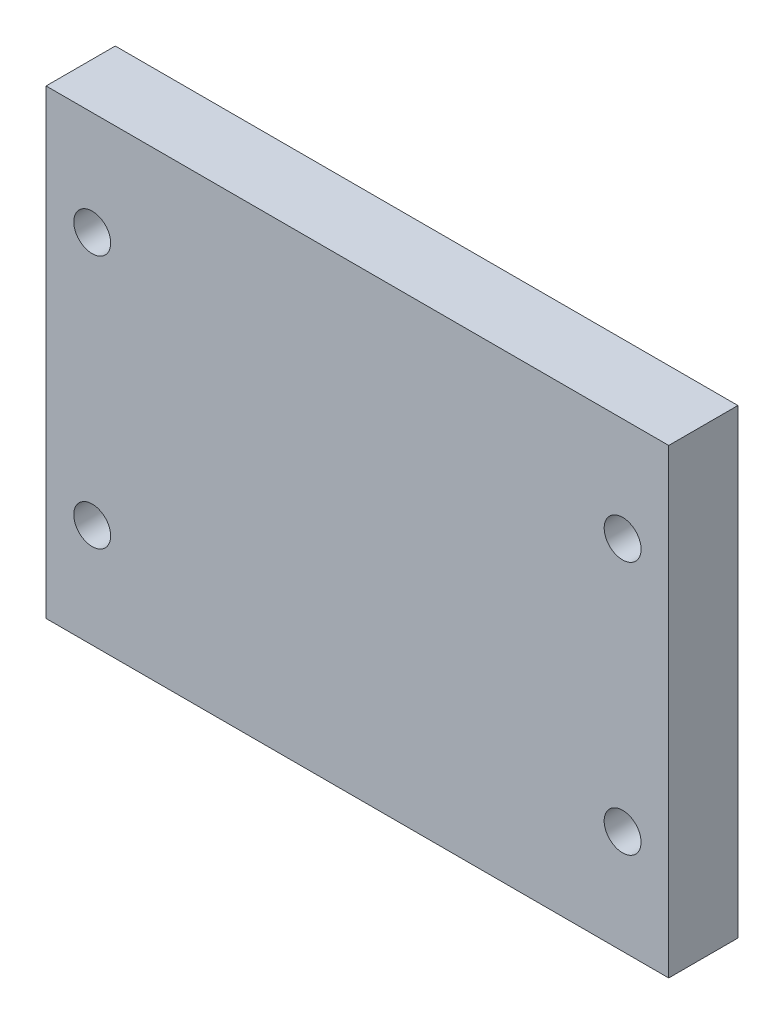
ISO-10303-21;
HEADER;
FILE_DESCRIPTION(('STEP AP214'),'2;1');
FILE_NAME('part.step','',(''),(''),'','','');
FILE_SCHEMA(('AUTOMOTIVE_DESIGN { 1 0 10303 214 1 1 1 1 }'));
ENDSEC;
DATA;
#1=APPLICATION_CONTEXT('core data for automotive mechanical design processes');
#2=APPLICATION_PROTOCOL_DEFINITION('international standard','automotive_design',2000,#1);
#3=PRODUCT_CONTEXT('',#1,'mechanical');
#4=PRODUCT('Part','Part','',(#3));
#5=PRODUCT_RELATED_PRODUCT_CATEGORY('part','',(#4));
#6=PRODUCT_DEFINITION_FORMATION('','',#4);
#7=PRODUCT_DEFINITION_CONTEXT('part definition',#1,'design');
#8=PRODUCT_DEFINITION('design','',#6,#7);
#9=PRODUCT_DEFINITION_SHAPE('','',#8);
#10=(LENGTH_UNIT() NAMED_UNIT(*) SI_UNIT(.MILLI.,.METRE.));
#11=(NAMED_UNIT(*) PLANE_ANGLE_UNIT() SI_UNIT($,.RADIAN.));
#12=(NAMED_UNIT(*) SI_UNIT($,.STERADIAN.) SOLID_ANGLE_UNIT());
#13=UNCERTAINTY_MEASURE_WITH_UNIT(LENGTH_MEASURE(1.E-05),#10,'distance_accuracy_value','');
#14=(GEOMETRIC_REPRESENTATION_CONTEXT(3) GLOBAL_UNCERTAINTY_ASSIGNED_CONTEXT((#13)) GLOBAL_UNIT_ASSIGNED_CONTEXT((#10,
#11,#12)) REPRESENTATION_CONTEXT('',''));
#15=CARTESIAN_POINT('',(0.,0.,0.));
#16=DIRECTION('',(0.,0.,1.));
#17=DIRECTION('',(1.,0.,0.));
#18=AXIS2_PLACEMENT_3D('',#15,#16,#17);
#19=CARTESIAN_POINT('',(-35.481097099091,-21.1756929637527,6.));
#20=DIRECTION('',(0.,0.,1.));
#21=DIRECTION('',(1.,0.,0.));
#22=AXIS2_PLACEMENT_3D('',#19,#20,#21);
#23=PLANE('',#22);
#24=CARTESIAN_POINT('',(14.518902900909,-12.1756929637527,6.));
#25=DIRECTION('',(0.,0.,1.));
#26=DIRECTION('',(1.,0.,0.));
#27=AXIS2_PLACEMENT_3D('',#24,#25,#26);
#28=CIRCLE('',#27,1.6);
#29=CARTESIAN_POINT('',(16.118902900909,-12.1756929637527,6.));
#30=VERTEX_POINT('',#29);
#31=EDGE_CURVE('E116',#30,#30,#28,.T.);
#32=ORIENTED_EDGE('',*,*,#31,.F.);
#33=EDGE_LOOP('',(#32));
#34=FACE_BOUND('',#33,.T.);
#35=CARTESIAN_POINT('',(-31.481097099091,9.82430703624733,6.));
#36=DIRECTION('',(0.,0.,1.));
#37=DIRECTION('',(1.,0.,0.));
#38=AXIS2_PLACEMENT_3D('',#35,#36,#37);
#39=CIRCLE('',#38,1.6);
#40=CARTESIAN_POINT('',(-29.881097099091,9.82430703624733,6.));
#41=VERTEX_POINT('',#40);
#42=EDGE_CURVE('E95',#41,#41,#39,.T.);
#43=ORIENTED_EDGE('',*,*,#42,.F.);
#44=EDGE_LOOP('',(#43));
#45=FACE_BOUND('',#44,.T.);
#46=DIRECTION('',(0.,-1.,0.));
#47=VECTOR('',#46,1.);
#48=CARTESIAN_POINT('',(-35.481097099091,18.8243070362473,6.));
#49=LINE('',#48,#47);
#50=CARTESIAN_POINT('',(-35.481097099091,18.8243070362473,6.));
#51=VERTEX_POINT('',#50);
#52=CARTESIAN_POINT('',(-35.481097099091,-21.1756929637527,6.));
#53=VERTEX_POINT('',#52);
#54=EDGE_CURVE('E80',#51,#53,#49,.T.);
#55=ORIENTED_EDGE('',*,*,#54,.T.);
#56=DIRECTION('',(1.,0.,0.));
#57=VECTOR('',#56,1.);
#58=CARTESIAN_POINT('',(-35.481097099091,-21.1756929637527,6.));
#59=LINE('',#58,#57);
#60=CARTESIAN_POINT('',(18.518902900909,-21.1756929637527,6.));
#61=VERTEX_POINT('',#60);
#62=EDGE_CURVE('E75',#53,#61,#59,.T.);
#63=ORIENTED_EDGE('',*,*,#62,.T.);
#64=DIRECTION('',(0.,1.,0.));
#65=VECTOR('',#64,1.);
#66=CARTESIAN_POINT('',(18.518902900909,18.8243070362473,6.));
#67=LINE('',#66,#65);
#68=CARTESIAN_POINT('',(18.518902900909,18.8243070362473,6.));
#69=VERTEX_POINT('',#68);
#70=EDGE_CURVE('E78',#61,#69,#67,.T.);
#71=ORIENTED_EDGE('',*,*,#70,.T.);
#72=DIRECTION('',(-1.,0.,0.));
#73=VECTOR('',#72,1.);
#74=CARTESIAN_POINT('',(-35.481097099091,18.8243070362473,6.));
#75=LINE('',#74,#73);
#76=EDGE_CURVE('E45',#69,#51,#75,.T.);
#77=ORIENTED_EDGE('',*,*,#76,.T.);
#78=EDGE_LOOP('',(#55,#63,#71,#77));
#79=FACE_BOUND('',#78,.T.);
#80=CARTESIAN_POINT('',(14.518902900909,9.82430703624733,6.));
#81=DIRECTION('',(0.,0.,1.));
#82=DIRECTION('',(-1.,0.,0.));
#83=AXIS2_PLACEMENT_3D('',#80,#81,#82);
#84=CIRCLE('',#83,1.6);
#85=CARTESIAN_POINT('',(12.918902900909,9.82430703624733,6.));
#86=VERTEX_POINT('',#85);
#87=EDGE_CURVE('E110',#86,#86,#84,.T.);
#88=ORIENTED_EDGE('',*,*,#87,.F.);
#89=EDGE_LOOP('',(#88));
#90=FACE_BOUND('',#89,.T.);
#91=CARTESIAN_POINT('',(-31.481097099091,-12.1756929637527,6.));
#92=DIRECTION('',(0.,0.,1.));
#93=DIRECTION('',(-1.,0.,0.));
#94=AXIS2_PLACEMENT_3D('',#91,#92,#93);
#95=CIRCLE('',#94,1.6);
#96=CARTESIAN_POINT('',(-33.081097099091,-12.1756929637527,6.));
#97=VERTEX_POINT('',#96);
#98=EDGE_CURVE('E122',#97,#97,#95,.T.);
#99=ORIENTED_EDGE('',*,*,#98,.F.);
#100=EDGE_LOOP('',(#99));
#101=FACE_BOUND('',#100,.T.);
#102=ADVANCED_FACE('F28',(#34,#45,#79,#90,#101),#23,.T.);
#103=CARTESIAN_POINT('',(-35.481097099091,-21.1756929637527,0.));
#104=DIRECTION('',(0.,0.,1.));
#105=DIRECTION('',(1.,0.,0.));
#106=AXIS2_PLACEMENT_3D('',#103,#104,#105);
#107=PLANE('',#106);
#108=CARTESIAN_POINT('',(14.518902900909,-12.1756929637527,0.));
#109=DIRECTION('',(0.,0.,1.));
#110=DIRECTION('',(1.,0.,0.));
#111=AXIS2_PLACEMENT_3D('',#108,#109,#110);
#112=CIRCLE('',#111,1.6);
#113=CARTESIAN_POINT('',(16.118902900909,-12.1756929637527,0.));
#114=VERTEX_POINT('',#113);
#115=EDGE_CURVE('E119',#114,#114,#112,.T.);
#116=ORIENTED_EDGE('',*,*,#115,.T.);
#117=EDGE_LOOP('',(#116));
#118=FACE_BOUND('',#117,.T.);
#119=CARTESIAN_POINT('',(-31.481097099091,9.82430703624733,0.));
#120=DIRECTION('',(0.,0.,1.));
#121=DIRECTION('',(1.,0.,0.));
#122=AXIS2_PLACEMENT_3D('',#119,#120,#121);
#123=CIRCLE('',#122,1.6);
#124=CARTESIAN_POINT('',(-29.881097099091,9.82430703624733,0.));
#125=VERTEX_POINT('',#124);
#126=EDGE_CURVE('E107',#125,#125,#123,.T.);
#127=ORIENTED_EDGE('',*,*,#126,.T.);
#128=EDGE_LOOP('',(#127));
#129=FACE_BOUND('',#128,.T.);
#130=DIRECTION('',(0.,-1.,0.));
#131=VECTOR('',#130,1.);
#132=CARTESIAN_POINT('',(-35.481097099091,18.8243070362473,0.));
#133=LINE('',#132,#131);
#134=CARTESIAN_POINT('',(-35.481097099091,18.8243070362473,0.));
#135=VERTEX_POINT('',#134);
#136=CARTESIAN_POINT('',(-35.481097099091,-21.1756929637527,0.));
#137=VERTEX_POINT('',#136);
#138=EDGE_CURVE('E92',#135,#137,#133,.T.);
#139=ORIENTED_EDGE('',*,*,#138,.F.);
#140=DIRECTION('',(-1.,0.,0.));
#141=VECTOR('',#140,1.);
#142=CARTESIAN_POINT('',(-35.481097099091,18.8243070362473,0.));
#143=LINE('',#142,#141);
#144=CARTESIAN_POINT('',(18.518902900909,18.8243070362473,0.));
#145=VERTEX_POINT('',#144);
#146=EDGE_CURVE('E68',#145,#135,#143,.T.);
#147=ORIENTED_EDGE('',*,*,#146,.F.);
#148=DIRECTION('',(0.,1.,0.));
#149=VECTOR('',#148,1.);
#150=CARTESIAN_POINT('',(18.518902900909,18.8243070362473,0.));
#151=LINE('',#150,#149);
#152=CARTESIAN_POINT('',(18.518902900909,-21.1756929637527,0.));
#153=VERTEX_POINT('',#152);
#154=EDGE_CURVE('E62',#153,#145,#151,.T.);
#155=ORIENTED_EDGE('',*,*,#154,.F.);
#156=DIRECTION('',(1.,0.,0.));
#157=VECTOR('',#156,1.);
#158=CARTESIAN_POINT('',(-35.481097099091,-21.1756929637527,0.));
#159=LINE('',#158,#157);
#160=EDGE_CURVE('E84',#137,#153,#159,.T.);
#161=ORIENTED_EDGE('',*,*,#160,.F.);
#162=EDGE_LOOP('',(#139,#147,#155,#161));
#163=FACE_BOUND('',#162,.T.);
#164=CARTESIAN_POINT('',(14.518902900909,9.82430703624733,0.));
#165=DIRECTION('',(0.,0.,1.));
#166=DIRECTION('',(-1.,0.,0.));
#167=AXIS2_PLACEMENT_3D('',#164,#165,#166);
#168=CIRCLE('',#167,1.6);
#169=CARTESIAN_POINT('',(12.918902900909,9.82430703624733,0.));
#170=VERTEX_POINT('',#169);
#171=EDGE_CURVE('E113',#170,#170,#168,.T.);
#172=ORIENTED_EDGE('',*,*,#171,.T.);
#173=EDGE_LOOP('',(#172));
#174=FACE_BOUND('',#173,.T.);
#175=CARTESIAN_POINT('',(-31.481097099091,-12.1756929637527,0.));
#176=DIRECTION('',(0.,0.,1.));
#177=DIRECTION('',(-1.,0.,0.));
#178=AXIS2_PLACEMENT_3D('',#175,#176,#177);
#179=CIRCLE('',#178,1.6);
#180=CARTESIAN_POINT('',(-33.081097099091,-12.1756929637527,0.));
#181=VERTEX_POINT('',#180);
#182=EDGE_CURVE('E125',#181,#181,#179,.T.);
#183=ORIENTED_EDGE('',*,*,#182,.T.);
#184=EDGE_LOOP('',(#183));
#185=FACE_BOUND('',#184,.T.);
#186=ADVANCED_FACE('F103',(#118,#129,#163,#174,#185),#107,.F.);
#187=CARTESIAN_POINT('',(-35.481097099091,18.8243070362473,6.));
#188=DIRECTION('',(1.,0.,0.));
#189=DIRECTION('',(0.,0.,-1.));
#190=AXIS2_PLACEMENT_3D('',#187,#188,#189);
#191=PLANE('',#190);
#192=ORIENTED_EDGE('',*,*,#138,.T.);
#193=DIRECTION('',(0.,0.,-1.));
#194=VECTOR('',#193,1.);
#195=CARTESIAN_POINT('',(-35.481097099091,-21.1756929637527,6.));
#196=LINE('',#195,#194);
#197=EDGE_CURVE('E11',#53,#137,#196,.T.);
#198=ORIENTED_EDGE('',*,*,#197,.F.);
#199=ORIENTED_EDGE('',*,*,#54,.F.);
#200=DIRECTION('',(0.,0.,-1.));
#201=VECTOR('',#200,1.);
#202=CARTESIAN_POINT('',(-35.481097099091,18.8243070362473,6.));
#203=LINE('',#202,#201);
#204=EDGE_CURVE('E88',#51,#135,#203,.T.);
#205=ORIENTED_EDGE('',*,*,#204,.T.);
#206=EDGE_LOOP('',(#192,#198,#199,#205));
#207=FACE_BOUND('',#206,.T.);
#208=ADVANCED_FACE('F30',(#207),#191,.F.);
#209=CARTESIAN_POINT('',(-35.481097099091,-21.1756929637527,6.));
#210=DIRECTION('',(0.,1.,0.));
#211=DIRECTION('',(0.,0.,1.));
#212=AXIS2_PLACEMENT_3D('',#209,#210,#211);
#213=PLANE('',#212);
#214=ORIENTED_EDGE('',*,*,#160,.T.);
#215=DIRECTION('',(0.,0.,-1.));
#216=VECTOR('',#215,1.);
#217=CARTESIAN_POINT('',(18.518902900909,-21.1756929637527,6.));
#218=LINE('',#217,#216);
#219=EDGE_CURVE('E37',#61,#153,#218,.T.);
#220=ORIENTED_EDGE('',*,*,#219,.F.);
#221=ORIENTED_EDGE('',*,*,#62,.F.);
#222=ORIENTED_EDGE('',*,*,#197,.T.);
#223=EDGE_LOOP('',(#214,#220,#221,#222));
#224=FACE_BOUND('',#223,.T.);
#225=ADVANCED_FACE('F83',(#224),#213,.F.);
#226=CARTESIAN_POINT('',(18.518902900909,18.8243070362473,6.));
#227=DIRECTION('',(-1.,0.,0.));
#228=DIRECTION('',(0.,-1.,0.));
#229=AXIS2_PLACEMENT_3D('',#226,#227,#228);
#230=PLANE('',#229);
#231=ORIENTED_EDGE('',*,*,#154,.T.);
#232=DIRECTION('',(0.,0.,-1.));
#233=VECTOR('',#232,1.);
#234=CARTESIAN_POINT('',(18.518902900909,18.8243070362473,6.));
#235=LINE('',#234,#233);
#236=EDGE_CURVE('E85',#69,#145,#235,.T.);
#237=ORIENTED_EDGE('',*,*,#236,.F.);
#238=ORIENTED_EDGE('',*,*,#70,.F.);
#239=ORIENTED_EDGE('',*,*,#219,.T.);
#240=EDGE_LOOP('',(#231,#237,#238,#239));
#241=FACE_BOUND('',#240,.T.);
#242=ADVANCED_FACE('F86',(#241),#230,.F.);
#243=CARTESIAN_POINT('',(-35.481097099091,18.8243070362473,6.));
#244=DIRECTION('',(0.,-1.,0.));
#245=DIRECTION('',(0.,0.,-1.));
#246=AXIS2_PLACEMENT_3D('',#243,#244,#245);
#247=PLANE('',#246);
#248=ORIENTED_EDGE('',*,*,#146,.T.);
#249=ORIENTED_EDGE('',*,*,#204,.F.);
#250=ORIENTED_EDGE('',*,*,#76,.F.);
#251=ORIENTED_EDGE('',*,*,#236,.T.);
#252=EDGE_LOOP('',(#248,#249,#250,#251));
#253=FACE_BOUND('',#252,.T.);
#254=ADVANCED_FACE('F100',(#253),#247,.F.);
#255=CARTESIAN_POINT('',(-31.481097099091,9.82430703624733,6.));
#256=DIRECTION('',(0.,0.,-1.));
#257=DIRECTION('',(-1.,0.,0.));
#258=AXIS2_PLACEMENT_3D('',#255,#256,#257);
#259=CYLINDRICAL_SURFACE('',#258,1.6);
#260=ORIENTED_EDGE('',*,*,#42,.T.);
#261=EDGE_LOOP('',(#260));
#262=FACE_BOUND('',#261,.T.);
#263=ORIENTED_EDGE('',*,*,#126,.F.);
#264=EDGE_LOOP('',(#263));
#265=FACE_BOUND('',#264,.T.);
#266=ADVANCED_FACE('F145',(#262,#265),#259,.F.);
#267=CARTESIAN_POINT('',(14.518902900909,9.82430703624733,6.));
#268=DIRECTION('',(0.,0.,-1.));
#269=DIRECTION('',(-1.,0.,0.));
#270=AXIS2_PLACEMENT_3D('',#267,#268,#269);
#271=CYLINDRICAL_SURFACE('',#270,1.6);
#272=ORIENTED_EDGE('',*,*,#87,.T.);
#273=EDGE_LOOP('',(#272));
#274=FACE_BOUND('',#273,.T.);
#275=ORIENTED_EDGE('',*,*,#171,.F.);
#276=EDGE_LOOP('',(#275));
#277=FACE_BOUND('',#276,.T.);
#278=ADVANCED_FACE('F191',(#274,#277),#271,.F.);
#279=CARTESIAN_POINT('',(14.518902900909,-12.1756929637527,6.));
#280=DIRECTION('',(0.,0.,-1.));
#281=DIRECTION('',(-1.,0.,0.));
#282=AXIS2_PLACEMENT_3D('',#279,#280,#281);
#283=CYLINDRICAL_SURFACE('',#282,1.6);
#284=ORIENTED_EDGE('',*,*,#31,.T.);
#285=EDGE_LOOP('',(#284));
#286=FACE_BOUND('',#285,.T.);
#287=ORIENTED_EDGE('',*,*,#115,.F.);
#288=EDGE_LOOP('',(#287));
#289=FACE_BOUND('',#288,.T.);
#290=ADVANCED_FACE('F199',(#286,#289),#283,.F.);
#291=CARTESIAN_POINT('',(-31.481097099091,-12.1756929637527,6.));
#292=DIRECTION('',(0.,0.,-1.));
#293=DIRECTION('',(-1.,0.,0.));
#294=AXIS2_PLACEMENT_3D('',#291,#292,#293);
#295=CYLINDRICAL_SURFACE('',#294,1.6);
#296=ORIENTED_EDGE('',*,*,#98,.T.);
#297=EDGE_LOOP('',(#296));
#298=FACE_BOUND('',#297,.T.);
#299=ORIENTED_EDGE('',*,*,#182,.F.);
#300=EDGE_LOOP('',(#299));
#301=FACE_BOUND('',#300,.T.);
#302=ADVANCED_FACE('F131',(#298,#301),#295,.F.);
#303=CLOSED_SHELL('',(#102,#186,#208,#225,#242,#254,#266,#278,#290,#302));
#304=MANIFOLD_SOLID_BREP('B2',#303);
#305=ADVANCED_BREP_SHAPE_REPRESENTATION('',(#18,#304),#14);
#306=SHAPE_DEFINITION_REPRESENTATION(#9,#305);
ENDSEC;
END-ISO-10303-21;
